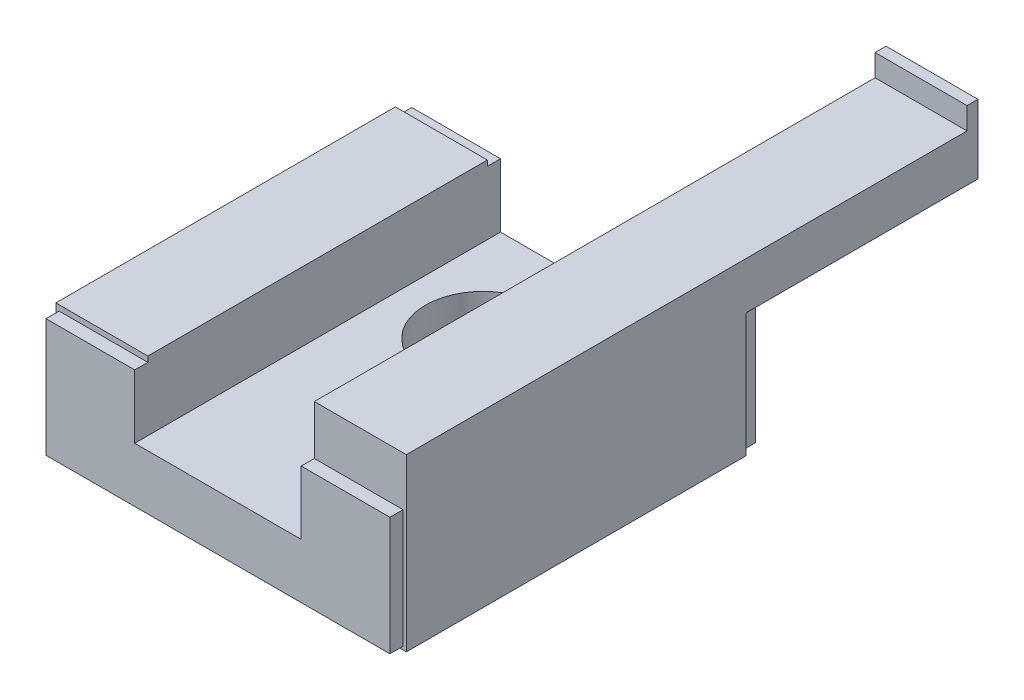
ISO-10303-21;
HEADER;
FILE_DESCRIPTION(('STEP AP214'),'2;1');
FILE_NAME('part.step','',(''),(''),'','','');
FILE_SCHEMA(('AUTOMOTIVE_DESIGN { 1 0 10303 214 1 1 1 1 }'));
ENDSEC;
DATA;
#1=APPLICATION_CONTEXT('core data for automotive mechanical design processes');
#2=APPLICATION_PROTOCOL_DEFINITION('international standard','automotive_design',2000,#1);
#3=PRODUCT_CONTEXT('',#1,'mechanical');
#4=PRODUCT('Part','Part','',(#3));
#5=PRODUCT_RELATED_PRODUCT_CATEGORY('part','',(#4));
#6=PRODUCT_DEFINITION_FORMATION('','',#4);
#7=PRODUCT_DEFINITION_CONTEXT('part definition',#1,'design');
#8=PRODUCT_DEFINITION('design','',#6,#7);
#9=PRODUCT_DEFINITION_SHAPE('','',#8);
#10=(LENGTH_UNIT() NAMED_UNIT(*) SI_UNIT(.MILLI.,.METRE.));
#11=(NAMED_UNIT(*) PLANE_ANGLE_UNIT() SI_UNIT($,.RADIAN.));
#12=(NAMED_UNIT(*) SI_UNIT($,.STERADIAN.) SOLID_ANGLE_UNIT());
#13=UNCERTAINTY_MEASURE_WITH_UNIT(LENGTH_MEASURE(1.E-05),#10,'distance_accuracy_value','');
#14=(GEOMETRIC_REPRESENTATION_CONTEXT(3) GLOBAL_UNCERTAINTY_ASSIGNED_CONTEXT((#13)) GLOBAL_UNIT_ASSIGNED_CONTEXT((#10,
#11,#12)) REPRESENTATION_CONTEXT('',''));
#15=CARTESIAN_POINT('',(0.,0.,0.));
#16=DIRECTION('',(0.,0.,1.));
#17=DIRECTION('',(1.,0.,0.));
#18=AXIS2_PLACEMENT_3D('',#15,#16,#17);
#19=CARTESIAN_POINT('',(7.6,15.6,32.2));
#20=DIRECTION('',(0.,1.,0.));
#21=DIRECTION('',(1.,0.,0.));
#22=AXIS2_PLACEMENT_3D('',#19,#20,#21);
#23=PLANE('',#22);
#24=DIRECTION('',(-1.,0.,0.));
#25=VECTOR('',#24,1.);
#26=CARTESIAN_POINT('',(16.,15.6,-19.));
#27=LINE('',#26,#25);
#28=CARTESIAN_POINT('',(7.6,15.6,-19.));
#29=VERTEX_POINT('',#28);
#30=CARTESIAN_POINT('',(16.,15.6,-19.));
#31=VERTEX_POINT('',#30);
#32=EDGE_CURVE('E197',#29,#31,#27,.F.);
#33=ORIENTED_EDGE('',*,*,#32,.F.);
#34=DIRECTION('',(0.,0.,1.));
#35=VECTOR('',#34,1.);
#36=CARTESIAN_POINT('',(7.6,15.6,-19.));
#37=LINE('',#36,#35);
#38=CARTESIAN_POINT('',(7.6,15.6,32.2));
#39=VERTEX_POINT('',#38);
#40=EDGE_CURVE('E212',#39,#29,#37,.F.);
#41=ORIENTED_EDGE('',*,*,#40,.F.);
#42=DIRECTION('',(1.,0.,0.));
#43=VECTOR('',#42,1.);
#44=CARTESIAN_POINT('',(7.6,15.6,32.2));
#45=LINE('',#44,#43);
#46=CARTESIAN_POINT('',(16.,15.6,32.2));
#47=VERTEX_POINT('',#46);
#48=EDGE_CURVE('E221',#47,#39,#45,.F.);
#49=ORIENTED_EDGE('',*,*,#48,.F.);
#50=DIRECTION('',(0.,0.,-1.));
#51=VECTOR('',#50,1.);
#52=CARTESIAN_POINT('',(16.,15.6,32.2));
#53=LINE('',#52,#51);
#54=EDGE_CURVE('E214',#47,#31,#53,.T.);
#55=ORIENTED_EDGE('',*,*,#54,.T.);
#56=EDGE_LOOP('',(#33,#41,#49,#55));
#57=FACE_BOUND('',#56,.T.);
#58=ADVANCED_FACE('F16',(#57),#23,.T.);
#59=CARTESIAN_POINT('',(-16.,11.6,32.2));
#60=DIRECTION('',(0.,1.,0.));
#61=DIRECTION('',(1.,0.,0.));
#62=AXIS2_PLACEMENT_3D('',#59,#60,#61);
#63=PLANE('',#62);
#64=DIRECTION('',(1.,0.,0.));
#65=VECTOR('',#64,1.);
#66=CARTESIAN_POINT('',(-16.,11.6,32.2));
#67=LINE('',#66,#65);
#68=CARTESIAN_POINT('',(-7.6,11.6,32.2));
#69=VERTEX_POINT('',#68);
#70=CARTESIAN_POINT('',(-16.,11.6,32.2));
#71=VERTEX_POINT('',#70);
#72=EDGE_CURVE('E232',#69,#71,#67,.F.);
#73=ORIENTED_EDGE('',*,*,#72,.F.);
#74=DIRECTION('',(0.,0.,-1.));
#75=VECTOR('',#74,1.);
#76=CARTESIAN_POINT('',(-7.6,11.6,32.2));
#77=LINE('',#76,#75);
#78=CARTESIAN_POINT('',(-7.6,11.6,1.20000000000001));
#79=VERTEX_POINT('',#78);
#80=EDGE_CURVE('E236',#69,#79,#77,.T.);
#81=ORIENTED_EDGE('',*,*,#80,.T.);
#82=DIRECTION('',(-1.,0.,0.));
#83=VECTOR('',#82,1.);
#84=CARTESIAN_POINT('',(-7.6,11.6,1.20000000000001));
#85=LINE('',#84,#83);
#86=CARTESIAN_POINT('',(-16.,11.6,1.20000000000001));
#87=VERTEX_POINT('',#86);
#88=EDGE_CURVE('E241',#79,#87,#85,.T.);
#89=ORIENTED_EDGE('',*,*,#88,.T.);
#90=DIRECTION('',(0.,0.,1.));
#91=VECTOR('',#90,1.);
#92=CARTESIAN_POINT('',(-16.,11.6,1.20000000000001));
#93=LINE('',#92,#91);
#94=EDGE_CURVE('E246',#71,#87,#93,.F.);
#95=ORIENTED_EDGE('',*,*,#94,.F.);
#96=EDGE_LOOP('',(#73,#81,#89,#95));
#97=FACE_BOUND('',#96,.T.);
#98=ADVANCED_FACE('F638',(#97),#63,.T.);
#99=CARTESIAN_POINT('',(-16.,0.,32.2));
#100=DIRECTION('',(-1.,0.,0.));
#101=DIRECTION('',(0.,1.,0.));
#102=AXIS2_PLACEMENT_3D('',#99,#100,#101);
#103=PLANE('',#102);
#104=DIRECTION('',(0.,1.,0.));
#105=VECTOR('',#104,1.);
#106=CARTESIAN_POINT('',(-16.,0.,32.2));
#107=LINE('',#106,#105);
#108=CARTESIAN_POINT('',(-16.,0.,32.2));
#109=VERTEX_POINT('',#108);
#110=EDGE_CURVE('E251',#71,#109,#107,.F.);
#111=ORIENTED_EDGE('',*,*,#110,.F.);
#112=ORIENTED_EDGE('',*,*,#94,.T.);
#113=DIRECTION('',(0.,-1.,0.));
#114=VECTOR('',#113,1.);
#115=CARTESIAN_POINT('',(-16.,11.6,1.20000000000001));
#116=LINE('',#115,#114);
#117=CARTESIAN_POINT('',(-16.,0.,1.20000000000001));
#118=VERTEX_POINT('',#117);
#119=EDGE_CURVE('E255',#87,#118,#116,.T.);
#120=ORIENTED_EDGE('',*,*,#119,.T.);
#121=DIRECTION('',(0.,0.,1.));
#122=VECTOR('',#121,1.);
#123=CARTESIAN_POINT('',(-16.,0.,1.20000000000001));
#124=LINE('',#123,#122);
#125=EDGE_CURVE('E260',#109,#118,#124,.F.);
#126=ORIENTED_EDGE('',*,*,#125,.F.);
#127=EDGE_LOOP('',(#111,#112,#120,#126));
#128=FACE_BOUND('',#127,.T.);
#129=ADVANCED_FACE('F643',(#128),#103,.T.);
#130=CARTESIAN_POINT('',(-16.,0.,1.2));
#131=DIRECTION('',(0.,-1.,0.));
#132=DIRECTION('',(1.,0.,0.));
#133=AXIS2_PLACEMENT_3D('',#130,#131,#132);
#134=PLANE('',#133);
#135=DIRECTION('',(-1.,0.,0.));
#136=VECTOR('',#135,1.);
#137=CARTESIAN_POINT('',(-8.,0.,32.2));
#138=LINE('',#137,#136);
#139=CARTESIAN_POINT('',(-8.,0.,32.2));
#140=VERTEX_POINT('',#139);
#141=EDGE_CURVE('E265',#109,#140,#138,.F.);
#142=ORIENTED_EDGE('',*,*,#141,.F.);
#143=ORIENTED_EDGE('',*,*,#125,.T.);
#144=DIRECTION('',(1.,0.,0.));
#145=VECTOR('',#144,1.);
#146=CARTESIAN_POINT('',(-16.,0.,1.2));
#147=LINE('',#146,#145);
#148=CARTESIAN_POINT('',(-8.,0.,1.2));
#149=VERTEX_POINT('',#148);
#150=EDGE_CURVE('E269',#118,#149,#147,.T.);
#151=ORIENTED_EDGE('',*,*,#150,.T.);
#152=DIRECTION('',(0.,0.,1.));
#153=VECTOR('',#152,1.);
#154=CARTESIAN_POINT('',(-8.,0.,1.2));
#155=LINE('',#154,#153);
#156=EDGE_CURVE('E274',#140,#149,#155,.F.);
#157=ORIENTED_EDGE('',*,*,#156,.F.);
#158=EDGE_LOOP('',(#142,#143,#151,#157));
#159=FACE_BOUND('',#158,.T.);
#160=CARTESIAN_POINT('',(-12.,0.,8.7));
#161=DIRECTION('',(0.,1.,0.));
#162=DIRECTION('',(0.,0.,-1.));
#163=AXIS2_PLACEMENT_3D('',#160,#161,#162);
#164=CIRCLE('',#163,2.);
#165=CARTESIAN_POINT('',(-12.,0.,6.7));
#166=VERTEX_POINT('',#165);
#167=EDGE_CURVE('E279',#166,#166,#164,.F.);
#168=ORIENTED_EDGE('',*,*,#167,.F.);
#169=EDGE_LOOP('',(#168));
#170=FACE_BOUND('',#169,.T.);
#171=CARTESIAN_POINT('',(-12.,0.,24.7));
#172=DIRECTION('',(0.,1.,0.));
#173=DIRECTION('',(0.,0.,-1.));
#174=AXIS2_PLACEMENT_3D('',#171,#172,#173);
#175=CIRCLE('',#174,2.);
#176=CARTESIAN_POINT('',(-12.,0.,22.7));
#177=VERTEX_POINT('',#176);
#178=EDGE_CURVE('E284',#177,#177,#175,.F.);
#179=ORIENTED_EDGE('',*,*,#178,.F.);
#180=EDGE_LOOP('',(#179));
#181=FACE_BOUND('',#180,.T.);
#182=ADVANCED_FACE('F649',(#159,#170,#181),#134,.T.);
#183=CARTESIAN_POINT('',(-7.7,0.300000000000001,1.2));
#184=DIRECTION('',(0.707106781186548,-0.707106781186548,0.));
#185=DIRECTION('',(0.,0.,1.));
#186=AXIS2_PLACEMENT_3D('',#183,#184,#185);
#187=PLANE('',#186);
#188=DIRECTION('',(-0.707106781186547,-0.707106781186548,0.));
#189=VECTOR('',#188,1.);
#190=CARTESIAN_POINT('',(-7.7,0.299999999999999,32.2));
#191=LINE('',#190,#189);
#192=CARTESIAN_POINT('',(-7.7,0.299999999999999,32.2));
#193=VERTEX_POINT('',#192);
#194=EDGE_CURVE('E287',#140,#193,#191,.F.);
#195=ORIENTED_EDGE('',*,*,#194,.F.);
#196=ORIENTED_EDGE('',*,*,#156,.T.);
#197=DIRECTION('',(0.707106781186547,0.707106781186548,0.));
#198=VECTOR('',#197,1.);
#199=CARTESIAN_POINT('',(-8.,0.,1.2));
#200=LINE('',#199,#198);
#201=CARTESIAN_POINT('',(-7.7,0.300000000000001,1.2));
#202=VERTEX_POINT('',#201);
#203=EDGE_CURVE('E289',#149,#202,#200,.T.);
#204=ORIENTED_EDGE('',*,*,#203,.T.);
#205=DIRECTION('',(0.,0.,1.));
#206=VECTOR('',#205,1.);
#207=CARTESIAN_POINT('',(-7.7,0.300000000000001,1.2));
#208=LINE('',#207,#206);
#209=EDGE_CURVE('E294',#193,#202,#208,.F.);
#210=ORIENTED_EDGE('',*,*,#209,.F.);
#211=EDGE_LOOP('',(#195,#196,#204,#210));
#212=FACE_BOUND('',#211,.T.);
#213=ADVANCED_FACE('F653',(#212),#187,.T.);
#214=CARTESIAN_POINT('',(8.,0.,1.2));
#215=DIRECTION('',(-0.707106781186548,-0.707106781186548,0.));
#216=DIRECTION('',(0.,0.,1.));
#217=AXIS2_PLACEMENT_3D('',#214,#215,#216);
#218=PLANE('',#217);
#219=DIRECTION('',(-0.707106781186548,0.707106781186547,0.));
#220=VECTOR('',#219,1.);
#221=CARTESIAN_POINT('',(8.,0.,32.2));
#222=LINE('',#221,#220);
#223=CARTESIAN_POINT('',(7.7,0.3,32.2));
#224=VERTEX_POINT('',#223);
#225=CARTESIAN_POINT('',(8.,0.,32.2));
#226=VERTEX_POINT('',#225);
#227=EDGE_CURVE('E299',#224,#226,#222,.F.);
#228=ORIENTED_EDGE('',*,*,#227,.F.);
#229=DIRECTION('',(0.,0.,-1.));
#230=VECTOR('',#229,1.);
#231=CARTESIAN_POINT('',(7.7,0.3,32.2));
#232=LINE('',#231,#230);
#233=CARTESIAN_POINT('',(7.7,0.299999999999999,1.2));
#234=VERTEX_POINT('',#233);
#235=EDGE_CURVE('E303',#224,#234,#232,.T.);
#236=ORIENTED_EDGE('',*,*,#235,.T.);
#237=DIRECTION('',(0.707106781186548,-0.707106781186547,0.));
#238=VECTOR('',#237,1.);
#239=CARTESIAN_POINT('',(7.7,0.299999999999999,1.2));
#240=LINE('',#239,#238);
#241=CARTESIAN_POINT('',(8.,0.,1.2));
#242=VERTEX_POINT('',#241);
#243=EDGE_CURVE('E308',#234,#242,#240,.T.);
#244=ORIENTED_EDGE('',*,*,#243,.T.);
#245=DIRECTION('',(0.,0.,1.));
#246=VECTOR('',#245,1.);
#247=CARTESIAN_POINT('',(8.,0.,1.2));
#248=LINE('',#247,#246);
#249=EDGE_CURVE('E313',#226,#242,#248,.F.);
#250=ORIENTED_EDGE('',*,*,#249,.F.);
#251=EDGE_LOOP('',(#228,#236,#244,#250));
#252=FACE_BOUND('',#251,.T.);
#253=ADVANCED_FACE('F657',(#252),#218,.T.);
#254=CARTESIAN_POINT('',(8.,0.,1.2));
#255=DIRECTION('',(0.,-1.,0.));
#256=DIRECTION('',(1.,0.,0.));
#257=AXIS2_PLACEMENT_3D('',#254,#255,#256);
#258=PLANE('',#257);
#259=DIRECTION('',(-1.,0.,0.));
#260=VECTOR('',#259,1.);
#261=CARTESIAN_POINT('',(16.,0.,32.2));
#262=LINE('',#261,#260);
#263=CARTESIAN_POINT('',(16.,0.,32.2));
#264=VERTEX_POINT('',#263);
#265=EDGE_CURVE('E318',#226,#264,#262,.F.);
#266=ORIENTED_EDGE('',*,*,#265,.F.);
#267=ORIENTED_EDGE('',*,*,#249,.T.);
#268=DIRECTION('',(1.,0.,0.));
#269=VECTOR('',#268,1.);
#270=CARTESIAN_POINT('',(8.,0.,1.2));
#271=LINE('',#270,#269);
#272=CARTESIAN_POINT('',(16.,0.,1.2));
#273=VERTEX_POINT('',#272);
#274=EDGE_CURVE('E322',#242,#273,#271,.T.);
#275=ORIENTED_EDGE('',*,*,#274,.T.);
#276=DIRECTION('',(0.,0.,1.));
#277=VECTOR('',#276,1.);
#278=CARTESIAN_POINT('',(16.,0.,1.2));
#279=LINE('',#278,#277);
#280=EDGE_CURVE('E327',#264,#273,#279,.F.);
#281=ORIENTED_EDGE('',*,*,#280,.F.);
#282=EDGE_LOOP('',(#266,#267,#275,#281));
#283=FACE_BOUND('',#282,.T.);
#284=CARTESIAN_POINT('',(12.,0.,8.7));
#285=DIRECTION('',(0.,1.,0.));
#286=DIRECTION('',(0.,0.,-1.));
#287=AXIS2_PLACEMENT_3D('',#284,#285,#286);
#288=CIRCLE('',#287,2.);
#289=CARTESIAN_POINT('',(12.,0.,6.7));
#290=VERTEX_POINT('',#289);
#291=EDGE_CURVE('E332',#290,#290,#288,.F.);
#292=ORIENTED_EDGE('',*,*,#291,.F.);
#293=EDGE_LOOP('',(#292));
#294=FACE_BOUND('',#293,.T.);
#295=CARTESIAN_POINT('',(12.,0.,24.7));
#296=DIRECTION('',(0.,1.,0.));
#297=DIRECTION('',(0.,0.,-1.));
#298=AXIS2_PLACEMENT_3D('',#295,#296,#297);
#299=CIRCLE('',#298,2.);
#300=CARTESIAN_POINT('',(12.,0.,22.7));
#301=VERTEX_POINT('',#300);
#302=EDGE_CURVE('E337',#301,#301,#299,.F.);
#303=ORIENTED_EDGE('',*,*,#302,.F.);
#304=EDGE_LOOP('',(#303));
#305=FACE_BOUND('',#304,.T.);
#306=ADVANCED_FACE('F661',(#283,#294,#305),#258,.T.);
#307=CARTESIAN_POINT('',(16.,0.,-20.));
#308=DIRECTION('',(1.,0.,0.));
#309=DIRECTION('',(0.,1.,0.));
#310=AXIS2_PLACEMENT_3D('',#307,#308,#309);
#311=PLANE('',#310);
#312=DIRECTION('',(0.,-1.,0.));
#313=VECTOR('',#312,1.);
#314=CARTESIAN_POINT('',(16.,15.6,32.2));
#315=LINE('',#314,#313);
#316=EDGE_CURVE('E340',#264,#47,#315,.F.);
#317=ORIENTED_EDGE('',*,*,#316,.F.);
#318=ORIENTED_EDGE('',*,*,#280,.T.);
#319=DIRECTION('',(0.,1.,0.));
#320=VECTOR('',#319,1.);
#321=CARTESIAN_POINT('',(16.,0.,1.2));
#322=LINE('',#321,#320);
#323=CARTESIAN_POINT('',(16.,11.3,1.2));
#324=VERTEX_POINT('',#323);
#325=EDGE_CURVE('E342',#273,#324,#322,.T.);
#326=ORIENTED_EDGE('',*,*,#325,.T.);
#327=DIRECTION('',(0.,0.,-1.));
#328=VECTOR('',#327,1.);
#329=CARTESIAN_POINT('',(16.,11.3,1.2));
#330=LINE('',#329,#328);
#331=CARTESIAN_POINT('',(16.,11.3,-20.));
#332=VERTEX_POINT('',#331);
#333=EDGE_CURVE('E347',#332,#324,#330,.F.);
#334=ORIENTED_EDGE('',*,*,#333,.F.);
#335=DIRECTION('',(0.,1.,0.));
#336=VECTOR('',#335,1.);
#337=CARTESIAN_POINT('',(16.,11.3,-20.));
#338=LINE('',#337,#336);
#339=CARTESIAN_POINT('',(16.,17.6,-20.));
#340=VERTEX_POINT('',#339);
#341=EDGE_CURVE('E351',#332,#340,#338,.T.);
#342=ORIENTED_EDGE('',*,*,#341,.T.);
#343=DIRECTION('',(0.,0.,1.));
#344=VECTOR('',#343,1.);
#345=CARTESIAN_POINT('',(16.,17.6,-20.));
#346=LINE('',#345,#344);
#347=CARTESIAN_POINT('',(16.,17.6,-19.));
#348=VERTEX_POINT('',#347);
#349=EDGE_CURVE('E356',#348,#340,#346,.F.);
#350=ORIENTED_EDGE('',*,*,#349,.F.);
#351=DIRECTION('',(0.,-1.,0.));
#352=VECTOR('',#351,1.);
#353=CARTESIAN_POINT('',(16.,17.6,-19.));
#354=LINE('',#353,#352);
#355=EDGE_CURVE('E360',#31,#348,#354,.F.);
#356=ORIENTED_EDGE('',*,*,#355,.F.);
#357=ORIENTED_EDGE('',*,*,#54,.F.);
#358=EDGE_LOOP('',(#317,#318,#326,#334,#342,#350,#356,#357));
#359=FACE_BOUND('',#358,.T.);
#360=ADVANCED_FACE('F665',(#359),#311,.T.);
#361=CARTESIAN_POINT('',(7.6,5.3,33.4));
#362=DIRECTION('',(-1.,0.,0.));
#363=DIRECTION('',(0.,1.,0.));
#364=AXIS2_PLACEMENT_3D('',#361,#362,#363);
#365=PLANE('',#364);
#366=DIRECTION('',(0.,0.,1.));
#367=VECTOR('',#366,1.);
#368=CARTESIAN_POINT('',(7.6,11.3,-20.));
#369=LINE('',#368,#367);
#370=CARTESIAN_POINT('',(7.6,11.3,-20.));
#371=VERTEX_POINT('',#370);
#372=CARTESIAN_POINT('',(7.6,11.3,0.));
#373=VERTEX_POINT('',#372);
#374=EDGE_CURVE('E364',#371,#373,#369,.T.);
#375=ORIENTED_EDGE('',*,*,#374,.T.);
#376=DIRECTION('',(0.,-1.,0.));
#377=VECTOR('',#376,1.);
#378=CARTESIAN_POINT('',(7.6,11.3,0.));
#379=LINE('',#378,#377);
#380=CARTESIAN_POINT('',(7.6,5.3,0.));
#381=VERTEX_POINT('',#380);
#382=EDGE_CURVE('E368',#373,#381,#379,.T.);
#383=ORIENTED_EDGE('',*,*,#382,.T.);
#384=DIRECTION('',(0.,0.,1.));
#385=VECTOR('',#384,1.);
#386=CARTESIAN_POINT('',(7.6,5.3,0.));
#387=LINE('',#386,#385);
#388=CARTESIAN_POINT('',(7.6,5.3,33.4));
#389=VERTEX_POINT('',#388);
#390=EDGE_CURVE('E373',#389,#381,#387,.F.);
#391=ORIENTED_EDGE('',*,*,#390,.F.);
#392=DIRECTION('',(0.,1.,0.));
#393=VECTOR('',#392,1.);
#394=CARTESIAN_POINT('',(7.6,5.3,33.4));
#395=LINE('',#394,#393);
#396=CARTESIAN_POINT('',(7.6,11.1,33.4));
#397=VERTEX_POINT('',#396);
#398=EDGE_CURVE('E377',#397,#389,#395,.F.);
#399=ORIENTED_EDGE('',*,*,#398,.F.);
#400=DIRECTION('',(0.,0.,-1.));
#401=VECTOR('',#400,1.);
#402=CARTESIAN_POINT('',(7.6,11.1,33.4));
#403=LINE('',#402,#401);
#404=CARTESIAN_POINT('',(7.6,11.1,32.2));
#405=VERTEX_POINT('',#404);
#406=EDGE_CURVE('E381',#405,#397,#403,.F.);
#407=ORIENTED_EDGE('',*,*,#406,.F.);
#408=DIRECTION('',(0.,1.,0.));
#409=VECTOR('',#408,1.);
#410=CARTESIAN_POINT('',(7.6,11.1,32.2));
#411=LINE('',#410,#409);
#412=EDGE_CURVE('E206',#39,#405,#411,.F.);
#413=ORIENTED_EDGE('',*,*,#412,.F.);
#414=ORIENTED_EDGE('',*,*,#40,.T.);
#415=DIRECTION('',(0.,1.,0.));
#416=VECTOR('',#415,1.);
#417=CARTESIAN_POINT('',(7.6,15.6,-19.));
#418=LINE('',#417,#416);
#419=CARTESIAN_POINT('',(7.6,17.6,-19.));
#420=VERTEX_POINT('',#419);
#421=EDGE_CURVE('E194',#420,#29,#418,.F.);
#422=ORIENTED_EDGE('',*,*,#421,.F.);
#423=DIRECTION('',(0.,0.,-1.));
#424=VECTOR('',#423,1.);
#425=CARTESIAN_POINT('',(7.6,17.6,-19.));
#426=LINE('',#425,#424);
#427=CARTESIAN_POINT('',(7.6,17.6,-20.));
#428=VERTEX_POINT('',#427);
#429=EDGE_CURVE('E205',#420,#428,#426,.T.);
#430=ORIENTED_EDGE('',*,*,#429,.T.);
#431=DIRECTION('',(0.,-1.,0.));
#432=VECTOR('',#431,1.);
#433=CARTESIAN_POINT('',(7.6,17.6,-20.));
#434=LINE('',#433,#432);
#435=EDGE_CURVE('E393',#428,#371,#434,.T.);
#436=ORIENTED_EDGE('',*,*,#435,.T.);
#437=EDGE_LOOP('',(#375,#383,#391,#399,#407,#413,#414,#422,#430,#436));
#438=FACE_BOUND('',#437,.T.);
#439=ADVANCED_FACE('F218',(#438),#365,.T.);
#440=CARTESIAN_POINT('',(-7.6,5.3,0.));
#441=DIRECTION('',(1.,0.,0.));
#442=DIRECTION('',(0.,1.,0.));
#443=AXIS2_PLACEMENT_3D('',#440,#441,#442);
#444=PLANE('',#443);
#445=DIRECTION('',(0.,-1.,0.));
#446=VECTOR('',#445,1.);
#447=CARTESIAN_POINT('',(-7.6,11.6,32.2));
#448=LINE('',#447,#446);
#449=CARTESIAN_POINT('',(-7.6,11.1,32.2));
#450=VERTEX_POINT('',#449);
#451=EDGE_CURVE('E398',#450,#69,#448,.F.);
#452=ORIENTED_EDGE('',*,*,#451,.F.);
#453=DIRECTION('',(0.,0.,1.));
#454=VECTOR('',#453,1.);
#455=CARTESIAN_POINT('',(-7.6,11.1,32.2));
#456=LINE('',#455,#454);
#457=CARTESIAN_POINT('',(-7.6,11.1,33.4));
#458=VERTEX_POINT('',#457);
#459=EDGE_CURVE('E402',#450,#458,#456,.T.);
#460=ORIENTED_EDGE('',*,*,#459,.T.);
#461=DIRECTION('',(0.,-1.,0.));
#462=VECTOR('',#461,1.);
#463=CARTESIAN_POINT('',(-7.6,11.1,33.4));
#464=LINE('',#463,#462);
#465=CARTESIAN_POINT('',(-7.6,5.3,33.4));
#466=VERTEX_POINT('',#465);
#467=EDGE_CURVE('E407',#466,#458,#464,.F.);
#468=ORIENTED_EDGE('',*,*,#467,.F.);
#469=DIRECTION('',(0.,0.,-1.));
#470=VECTOR('',#469,1.);
#471=CARTESIAN_POINT('',(-7.6,5.3,33.4));
#472=LINE('',#471,#470);
#473=CARTESIAN_POINT('',(-7.6,5.3,0.));
#474=VERTEX_POINT('',#473);
#475=EDGE_CURVE('E412',#466,#474,#472,.T.);
#476=ORIENTED_EDGE('',*,*,#475,.T.);
#477=DIRECTION('',(0.,1.,0.));
#478=VECTOR('',#477,1.);
#479=CARTESIAN_POINT('',(-7.6,5.3,0.));
#480=LINE('',#479,#478);
#481=CARTESIAN_POINT('',(-7.6,11.1,0.));
#482=VERTEX_POINT('',#481);
#483=EDGE_CURVE('E417',#474,#482,#480,.T.);
#484=ORIENTED_EDGE('',*,*,#483,.T.);
#485=DIRECTION('',(0.,0.,1.));
#486=VECTOR('',#485,1.);
#487=CARTESIAN_POINT('',(-7.6,11.1,0.));
#488=LINE('',#487,#486);
#489=CARTESIAN_POINT('',(-7.6,11.1,1.2));
#490=VERTEX_POINT('',#489);
#491=EDGE_CURVE('E422',#490,#482,#488,.F.);
#492=ORIENTED_EDGE('',*,*,#491,.F.);
#493=DIRECTION('',(0.,1.,0.));
#494=VECTOR('',#493,1.);
#495=CARTESIAN_POINT('',(-7.6,11.1,1.2));
#496=LINE('',#495,#494);
#497=EDGE_CURVE('E426',#490,#79,#496,.T.);
#498=ORIENTED_EDGE('',*,*,#497,.T.);
#499=ORIENTED_EDGE('',*,*,#80,.F.);
#500=EDGE_LOOP('',(#452,#460,#468,#476,#484,#492,#498,#499));
#501=FACE_BOUND('',#500,.T.);
#502=ADVANCED_FACE('F672',(#501),#444,.T.);
#503=CARTESIAN_POINT('',(-15.7,0.3,0.));
#504=DIRECTION('',(0.,0.,-1.));
#505=DIRECTION('',(0.,1.,0.));
#506=AXIS2_PLACEMENT_3D('',#503,#504,#505);
#507=PLANE('',#506);
#508=ORIENTED_EDGE('',*,*,#382,.F.);
#509=DIRECTION('',(1.,0.,0.));
#510=VECTOR('',#509,1.);
#511=CARTESIAN_POINT('',(7.6,11.3,0.));
#512=LINE('',#511,#510);
#513=CARTESIAN_POINT('',(15.7,11.3,0.));
#514=VERTEX_POINT('',#513);
#515=EDGE_CURVE('E431',#373,#514,#512,.T.);
#516=ORIENTED_EDGE('',*,*,#515,.T.);
#517=DIRECTION('',(0.,-1.,0.));
#518=VECTOR('',#517,1.);
#519=CARTESIAN_POINT('',(15.7,11.3,0.));
#520=LINE('',#519,#518);
#521=CARTESIAN_POINT('',(15.7,0.300000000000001,0.));
#522=VERTEX_POINT('',#521);
#523=EDGE_CURVE('E436',#514,#522,#520,.T.);
#524=ORIENTED_EDGE('',*,*,#523,.T.);
#525=DIRECTION('',(-1.,0.,0.));
#526=VECTOR('',#525,1.);
#527=CARTESIAN_POINT('',(15.7,0.3,0.));
#528=LINE('',#527,#526);
#529=CARTESIAN_POINT('',(-15.7,0.3,0.));
#530=VERTEX_POINT('',#529);
#531=EDGE_CURVE('E441',#530,#522,#528,.F.);
#532=ORIENTED_EDGE('',*,*,#531,.F.);
#533=DIRECTION('',(0.,1.,0.));
#534=VECTOR('',#533,1.);
#535=CARTESIAN_POINT('',(-15.7,0.3,0.));
#536=LINE('',#535,#534);
#537=CARTESIAN_POINT('',(-15.7,11.1,0.));
#538=VERTEX_POINT('',#537);
#539=EDGE_CURVE('E446',#530,#538,#536,.T.);
#540=ORIENTED_EDGE('',*,*,#539,.T.);
#541=DIRECTION('',(1.,0.,0.));
#542=VECTOR('',#541,1.);
#543=CARTESIAN_POINT('',(-15.7,11.1,0.));
#544=LINE('',#543,#542);
#545=EDGE_CURVE('E451',#538,#482,#544,.T.);
#546=ORIENTED_EDGE('',*,*,#545,.T.);
#547=ORIENTED_EDGE('',*,*,#483,.F.);
#548=DIRECTION('',(1.,0.,0.));
#549=VECTOR('',#548,1.);
#550=CARTESIAN_POINT('',(-7.6,5.3,0.));
#551=LINE('',#550,#549);
#552=EDGE_CURVE('E456',#381,#474,#551,.F.);
#553=ORIENTED_EDGE('',*,*,#552,.F.);
#554=EDGE_LOOP('',(#508,#516,#524,#532,#540,#546,#547,#553));
#555=FACE_BOUND('',#554,.T.);
#556=ADVANCED_FACE('F675',(#555),#507,.T.);
#557=CARTESIAN_POINT('',(-15.7,0.3,0.));
#558=DIRECTION('',(0.,-1.,0.));
#559=DIRECTION('',(1.,0.,0.));
#560=AXIS2_PLACEMENT_3D('',#557,#558,#559);
#561=PLANE('',#560);
#562=DIRECTION('',(-1.,0.,0.));
#563=VECTOR('',#562,1.);
#564=CARTESIAN_POINT('',(15.7,0.3,33.4));
#565=LINE('',#564,#563);
#566=CARTESIAN_POINT('',(-15.7,0.3,33.4));
#567=VERTEX_POINT('',#566);
#568=CARTESIAN_POINT('',(15.7,0.3,33.4));
#569=VERTEX_POINT('',#568);
#570=EDGE_CURVE('E460',#567,#569,#565,.F.);
#571=ORIENTED_EDGE('',*,*,#570,.F.);
#572=DIRECTION('',(0.,0.,-1.));
#573=VECTOR('',#572,1.);
#574=CARTESIAN_POINT('',(-15.7,0.3,33.4));
#575=LINE('',#574,#573);
#576=CARTESIAN_POINT('',(-15.7,0.3,32.2));
#577=VERTEX_POINT('',#576);
#578=EDGE_CURVE('E465',#577,#567,#575,.F.);
#579=ORIENTED_EDGE('',*,*,#578,.F.);
#580=DIRECTION('',(1.,0.,0.));
#581=VECTOR('',#580,1.);
#582=CARTESIAN_POINT('',(-15.7,0.3,32.2));
#583=LINE('',#582,#581);
#584=EDGE_CURVE('E469',#193,#577,#583,.F.);
#585=ORIENTED_EDGE('',*,*,#584,.F.);
#586=ORIENTED_EDGE('',*,*,#209,.T.);
#587=DIRECTION('',(-1.,0.,0.));
#588=VECTOR('',#587,1.);
#589=CARTESIAN_POINT('',(-7.7,0.3,1.2));
#590=LINE('',#589,#588);
#591=CARTESIAN_POINT('',(-15.7,0.3,1.2));
#592=VERTEX_POINT('',#591);
#593=EDGE_CURVE('E473',#202,#592,#590,.T.);
#594=ORIENTED_EDGE('',*,*,#593,.T.);
#595=DIRECTION('',(0.,0.,-1.));
#596=VECTOR('',#595,1.);
#597=CARTESIAN_POINT('',(-15.7,0.3,1.2));
#598=LINE('',#597,#596);
#599=EDGE_CURVE('E478',#592,#530,#598,.T.);
#600=ORIENTED_EDGE('',*,*,#599,.T.);
#601=ORIENTED_EDGE('',*,*,#531,.T.);
#602=DIRECTION('',(0.,0.,1.));
#603=VECTOR('',#602,1.);
#604=CARTESIAN_POINT('',(15.7,0.3,0.));
#605=LINE('',#604,#603);
#606=CARTESIAN_POINT('',(15.7,0.3,1.2));
#607=VERTEX_POINT('',#606);
#608=EDGE_CURVE('E483',#607,#522,#605,.F.);
#609=ORIENTED_EDGE('',*,*,#608,.F.);
#610=DIRECTION('',(-1.,0.,0.));
#611=VECTOR('',#610,1.);
#612=CARTESIAN_POINT('',(15.7,0.3,1.2));
#613=LINE('',#612,#611);
#614=EDGE_CURVE('E487',#607,#234,#613,.T.);
#615=ORIENTED_EDGE('',*,*,#614,.T.);
#616=ORIENTED_EDGE('',*,*,#235,.F.);
#617=DIRECTION('',(1.,0.,0.));
#618=VECTOR('',#617,1.);
#619=CARTESIAN_POINT('',(7.7,0.3,32.2));
#620=LINE('',#619,#618);
#621=CARTESIAN_POINT('',(15.7,0.3,32.2));
#622=VERTEX_POINT('',#621);
#623=EDGE_CURVE('E492',#622,#224,#620,.F.);
#624=ORIENTED_EDGE('',*,*,#623,.F.);
#625=DIRECTION('',(0.,0.,1.));
#626=VECTOR('',#625,1.);
#627=CARTESIAN_POINT('',(15.7,0.3,32.2));
#628=LINE('',#627,#626);
#629=EDGE_CURVE('E496',#622,#569,#628,.T.);
#630=ORIENTED_EDGE('',*,*,#629,.T.);
#631=EDGE_LOOP('',(#571,#579,#585,#586,#594,#600,#601,#609,#615,#616,#624,#630));
#632=FACE_BOUND('',#631,.T.);
#633=CARTESIAN_POINT('',(0.,0.3,9.2));
#634=DIRECTION('',(0.,1.,0.));
#635=DIRECTION('',(0.,0.,-1.));
#636=AXIS2_PLACEMENT_3D('',#633,#634,#635);
#637=CIRCLE('',#636,5.25);
#638=CARTESIAN_POINT('',(0.,0.3,3.95));
#639=VERTEX_POINT('',#638);
#640=EDGE_CURVE('E501',#639,#639,#637,.F.);
#641=ORIENTED_EDGE('',*,*,#640,.F.);
#642=EDGE_LOOP('',(#641));
#643=FACE_BOUND('',#642,.T.);
#644=CARTESIAN_POINT('',(0.,0.3,24.7));
#645=DIRECTION('',(0.,1.,0.));
#646=DIRECTION('',(0.,0.,-1.));
#647=AXIS2_PLACEMENT_3D('',#644,#645,#646);
#648=CIRCLE('',#647,1.5);
#649=CARTESIAN_POINT('',(0.,0.3,23.2));
#650=VERTEX_POINT('',#649);
#651=EDGE_CURVE('E506',#650,#650,#648,.F.);
#652=ORIENTED_EDGE('',*,*,#651,.F.);
#653=EDGE_LOOP('',(#652));
#654=FACE_BOUND('',#653,.T.);
#655=ADVANCED_FACE('F679',(#632,#643,#654),#561,.T.);
#656=CARTESIAN_POINT('',(-7.6,5.3,33.4));
#657=DIRECTION('',(0.,1.,0.));
#658=DIRECTION('',(1.,0.,0.));
#659=AXIS2_PLACEMENT_3D('',#656,#657,#658);
#660=PLANE('',#659);
#661=ORIENTED_EDGE('',*,*,#552,.T.);
#662=ORIENTED_EDGE('',*,*,#475,.F.);
#663=DIRECTION('',(1.,0.,0.));
#664=VECTOR('',#663,1.);
#665=CARTESIAN_POINT('',(-7.6,5.3,33.4));
#666=LINE('',#665,#664);
#667=EDGE_CURVE('E509',#389,#466,#666,.F.);
#668=ORIENTED_EDGE('',*,*,#667,.F.);
#669=ORIENTED_EDGE('',*,*,#390,.T.);
#670=EDGE_LOOP('',(#661,#662,#668,#669));
#671=FACE_BOUND('',#670,.T.);
#672=CARTESIAN_POINT('',(0.,5.3,9.2));
#673=DIRECTION('',(0.,-1.,0.));
#674=DIRECTION('',(0.,0.,1.));
#675=AXIS2_PLACEMENT_3D('',#672,#673,#674);
#676=CIRCLE('',#675,5.25);
#677=CARTESIAN_POINT('',(0.,5.3,14.45));
#678=VERTEX_POINT('',#677);
#679=EDGE_CURVE('E511',#678,#678,#676,.F.);
#680=ORIENTED_EDGE('',*,*,#679,.F.);
#681=EDGE_LOOP('',(#680));
#682=FACE_BOUND('',#681,.T.);
#683=ADVANCED_FACE('F683',(#671,#682),#660,.T.);
#684=CARTESIAN_POINT('',(-15.7,0.3,33.4));
#685=DIRECTION('',(0.,0.,1.));
#686=DIRECTION('',(1.,0.,0.));
#687=AXIS2_PLACEMENT_3D('',#684,#685,#686);
#688=PLANE('',#687);
#689=DIRECTION('',(-1.,0.,0.));
#690=VECTOR('',#689,1.);
#691=CARTESIAN_POINT('',(15.7,11.1,33.4));
#692=LINE('',#691,#690);
#693=CARTESIAN_POINT('',(15.7,11.1,33.4));
#694=VERTEX_POINT('',#693);
#695=EDGE_CURVE('E516',#397,#694,#692,.F.);
#696=ORIENTED_EDGE('',*,*,#695,.F.);
#697=ORIENTED_EDGE('',*,*,#398,.T.);
#698=ORIENTED_EDGE('',*,*,#667,.T.);
#699=ORIENTED_EDGE('',*,*,#467,.T.);
#700=DIRECTION('',(-1.,0.,0.));
#701=VECTOR('',#700,1.);
#702=CARTESIAN_POINT('',(-7.6,11.1,33.4));
#703=LINE('',#702,#701);
#704=CARTESIAN_POINT('',(-15.7,11.1,33.4));
#705=VERTEX_POINT('',#704);
#706=EDGE_CURVE('E519',#705,#458,#703,.F.);
#707=ORIENTED_EDGE('',*,*,#706,.F.);
#708=DIRECTION('',(0.,-1.,0.));
#709=VECTOR('',#708,1.);
#710=CARTESIAN_POINT('',(-15.7,11.1,33.4));
#711=LINE('',#710,#709);
#712=EDGE_CURVE('E523',#567,#705,#711,.F.);
#713=ORIENTED_EDGE('',*,*,#712,.F.);
#714=ORIENTED_EDGE('',*,*,#570,.T.);
#715=DIRECTION('',(0.,1.,0.));
#716=VECTOR('',#715,1.);
#717=CARTESIAN_POINT('',(15.7,0.300000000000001,33.4));
#718=LINE('',#717,#716);
#719=EDGE_CURVE('E527',#694,#569,#718,.F.);
#720=ORIENTED_EDGE('',*,*,#719,.F.);
#721=EDGE_LOOP('',(#696,#697,#698,#699,#707,#713,#714,#720));
#722=FACE_BOUND('',#721,.T.);
#723=ADVANCED_FACE('F687',(#722),#688,.T.);
#724=CARTESIAN_POINT('',(-15.7,11.1,0.));
#725=DIRECTION('',(0.,1.,0.));
#726=DIRECTION('',(0.,0.,1.));
#727=AXIS2_PLACEMENT_3D('',#724,#725,#726);
#728=PLANE('',#727);
#729=ORIENTED_EDGE('',*,*,#545,.F.);
#730=DIRECTION('',(0.,0.,1.));
#731=VECTOR('',#730,1.);
#732=CARTESIAN_POINT('',(-15.7,11.1,0.));
#733=LINE('',#732,#731);
#734=CARTESIAN_POINT('',(-15.7,11.1,1.2));
#735=VERTEX_POINT('',#734);
#736=EDGE_CURVE('E531',#735,#538,#733,.F.);
#737=ORIENTED_EDGE('',*,*,#736,.F.);
#738=DIRECTION('',(1.,0.,0.));
#739=VECTOR('',#738,1.);
#740=CARTESIAN_POINT('',(-15.7,11.1,1.2));
#741=LINE('',#740,#739);
#742=EDGE_CURVE('E535',#735,#490,#741,.T.);
#743=ORIENTED_EDGE('',*,*,#742,.T.);
#744=ORIENTED_EDGE('',*,*,#491,.T.);
#745=EDGE_LOOP('',(#729,#737,#743,#744));
#746=FACE_BOUND('',#745,.T.);
#747=ADVANCED_FACE('F691',(#746),#728,.T.);
#748=CARTESIAN_POINT('',(-15.7,0.3,0.));
#749=DIRECTION('',(-1.,0.,0.));
#750=DIRECTION('',(0.,0.,1.));
#751=AXIS2_PLACEMENT_3D('',#748,#749,#750);
#752=PLANE('',#751);
#753=ORIENTED_EDGE('',*,*,#539,.F.);
#754=ORIENTED_EDGE('',*,*,#599,.F.);
#755=DIRECTION('',(0.,1.,0.));
#756=VECTOR('',#755,1.);
#757=CARTESIAN_POINT('',(-15.7,0.3,1.2));
#758=LINE('',#757,#756);
#759=EDGE_CURVE('E540',#592,#735,#758,.T.);
#760=ORIENTED_EDGE('',*,*,#759,.T.);
#761=ORIENTED_EDGE('',*,*,#736,.T.);
#762=EDGE_LOOP('',(#753,#754,#760,#761));
#763=FACE_BOUND('',#762,.T.);
#764=ADVANCED_FACE('F695',(#763),#752,.T.);
#765=CARTESIAN_POINT('',(-16.,0.,1.2));
#766=DIRECTION('',(0.,0.,-1.));
#767=DIRECTION('',(0.,1.,0.));
#768=AXIS2_PLACEMENT_3D('',#765,#766,#767);
#769=PLANE('',#768);
#770=ORIENTED_EDGE('',*,*,#150,.F.);
#771=ORIENTED_EDGE('',*,*,#119,.F.);
#772=ORIENTED_EDGE('',*,*,#88,.F.);
#773=ORIENTED_EDGE('',*,*,#497,.F.);
#774=ORIENTED_EDGE('',*,*,#742,.F.);
#775=ORIENTED_EDGE('',*,*,#759,.F.);
#776=ORIENTED_EDGE('',*,*,#593,.F.);
#777=ORIENTED_EDGE('',*,*,#203,.F.);
#778=EDGE_LOOP('',(#770,#771,#772,#773,#774,#775,#776,#777));
#779=FACE_BOUND('',#778,.T.);
#780=ADVANCED_FACE('F699',(#779),#769,.T.);
#781=CARTESIAN_POINT('',(7.7,0.,1.2));
#782=DIRECTION('',(0.,0.,-1.));
#783=DIRECTION('',(0.,1.,0.));
#784=AXIS2_PLACEMENT_3D('',#781,#782,#783);
#785=PLANE('',#784);
#786=DIRECTION('',(0.,1.,0.));
#787=VECTOR('',#786,1.);
#788=CARTESIAN_POINT('',(15.7,0.300000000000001,1.2));
#789=LINE('',#788,#787);
#790=CARTESIAN_POINT('',(15.7,11.3,1.2));
#791=VERTEX_POINT('',#790);
#792=EDGE_CURVE('E545',#791,#607,#789,.F.);
#793=ORIENTED_EDGE('',*,*,#792,.F.);
#794=DIRECTION('',(1.,0.,0.));
#795=VECTOR('',#794,1.);
#796=CARTESIAN_POINT('',(15.7,11.3,1.2));
#797=LINE('',#796,#795);
#798=EDGE_CURVE('E549',#791,#324,#797,.T.);
#799=ORIENTED_EDGE('',*,*,#798,.T.);
#800=ORIENTED_EDGE('',*,*,#325,.F.);
#801=ORIENTED_EDGE('',*,*,#274,.F.);
#802=ORIENTED_EDGE('',*,*,#243,.F.);
#803=ORIENTED_EDGE('',*,*,#614,.F.);
#804=EDGE_LOOP('',(#793,#799,#800,#801,#802,#803));
#805=FACE_BOUND('',#804,.T.);
#806=ADVANCED_FACE('F703',(#805),#785,.T.);
#807=CARTESIAN_POINT('',(15.7,0.3,1.2));
#808=DIRECTION('',(1.,0.,0.));
#809=DIRECTION('',(0.,0.,-1.));
#810=AXIS2_PLACEMENT_3D('',#807,#808,#809);
#811=PLANE('',#810);
#812=DIRECTION('',(0.,0.,1.));
#813=VECTOR('',#812,1.);
#814=CARTESIAN_POINT('',(15.7,11.3,0.));
#815=LINE('',#814,#813);
#816=EDGE_CURVE('E554',#791,#514,#815,.F.);
#817=ORIENTED_EDGE('',*,*,#816,.F.);
#818=ORIENTED_EDGE('',*,*,#792,.T.);
#819=ORIENTED_EDGE('',*,*,#608,.T.);
#820=ORIENTED_EDGE('',*,*,#523,.F.);
#821=EDGE_LOOP('',(#817,#818,#819,#820));
#822=FACE_BOUND('',#821,.T.);
#823=ADVANCED_FACE('F707',(#822),#811,.T.);
#824=CARTESIAN_POINT('',(-15.7,11.1,33.4));
#825=DIRECTION('',(0.,1.,0.));
#826=DIRECTION('',(1.,0.,0.));
#827=AXIS2_PLACEMENT_3D('',#824,#825,#826);
#828=PLANE('',#827);
#829=ORIENTED_EDGE('',*,*,#706,.T.);
#830=ORIENTED_EDGE('',*,*,#459,.F.);
#831=DIRECTION('',(-1.,0.,0.));
#832=VECTOR('',#831,1.);
#833=CARTESIAN_POINT('',(-7.6,11.1,32.2));
#834=LINE('',#833,#832);
#835=CARTESIAN_POINT('',(-15.7,11.1,32.2));
#836=VERTEX_POINT('',#835);
#837=EDGE_CURVE('E558',#836,#450,#834,.F.);
#838=ORIENTED_EDGE('',*,*,#837,.F.);
#839=DIRECTION('',(0.,0.,1.));
#840=VECTOR('',#839,1.);
#841=CARTESIAN_POINT('',(-15.7,11.1,32.2));
#842=LINE('',#841,#840);
#843=EDGE_CURVE('E562',#836,#705,#842,.T.);
#844=ORIENTED_EDGE('',*,*,#843,.T.);
#845=EDGE_LOOP('',(#829,#830,#838,#844));
#846=FACE_BOUND('',#845,.T.);
#847=ADVANCED_FACE('F711',(#846),#828,.T.);
#848=CARTESIAN_POINT('',(-15.7,0.3,33.4));
#849=DIRECTION('',(-1.,0.,0.));
#850=DIRECTION('',(0.,1.,0.));
#851=AXIS2_PLACEMENT_3D('',#848,#849,#850);
#852=PLANE('',#851);
#853=ORIENTED_EDGE('',*,*,#712,.T.);
#854=ORIENTED_EDGE('',*,*,#843,.F.);
#855=DIRECTION('',(0.,-1.,0.));
#856=VECTOR('',#855,1.);
#857=CARTESIAN_POINT('',(-15.7,11.1,32.2));
#858=LINE('',#857,#856);
#859=EDGE_CURVE('E39',#577,#836,#858,.F.);
#860=ORIENTED_EDGE('',*,*,#859,.F.);
#861=ORIENTED_EDGE('',*,*,#578,.T.);
#862=EDGE_LOOP('',(#853,#854,#860,#861));
#863=FACE_BOUND('',#862,.T.);
#864=ADVANCED_FACE('F715',(#863),#852,.T.);
#865=CARTESIAN_POINT('',(-16.,0.,32.2));
#866=DIRECTION('',(0.,0.,1.));
#867=DIRECTION('',(1.,0.,0.));
#868=AXIS2_PLACEMENT_3D('',#865,#866,#867);
#869=PLANE('',#868);
#870=ORIENTED_EDGE('',*,*,#194,.T.);
#871=ORIENTED_EDGE('',*,*,#584,.T.);
#872=ORIENTED_EDGE('',*,*,#859,.T.);
#873=ORIENTED_EDGE('',*,*,#837,.T.);
#874=ORIENTED_EDGE('',*,*,#451,.T.);
#875=ORIENTED_EDGE('',*,*,#72,.T.);
#876=ORIENTED_EDGE('',*,*,#110,.T.);
#877=ORIENTED_EDGE('',*,*,#141,.T.);
#878=EDGE_LOOP('',(#870,#871,#872,#873,#874,#875,#876,#877));
#879=FACE_BOUND('',#878,.T.);
#880=ADVANCED_FACE('F719',(#879),#869,.T.);
#881=CARTESIAN_POINT('',(7.6,0.,32.2));
#882=DIRECTION('',(0.,0.,1.));
#883=DIRECTION('',(1.,0.,0.));
#884=AXIS2_PLACEMENT_3D('',#881,#882,#883);
#885=PLANE('',#884);
#886=ORIENTED_EDGE('',*,*,#227,.T.);
#887=ORIENTED_EDGE('',*,*,#265,.T.);
#888=ORIENTED_EDGE('',*,*,#316,.T.);
#889=ORIENTED_EDGE('',*,*,#48,.T.);
#890=ORIENTED_EDGE('',*,*,#412,.T.);
#891=DIRECTION('',(1.,0.,0.));
#892=VECTOR('',#891,1.);
#893=CARTESIAN_POINT('',(7.6,11.1,32.2));
#894=LINE('',#893,#892);
#895=CARTESIAN_POINT('',(15.7,11.1,32.2));
#896=VERTEX_POINT('',#895);
#897=EDGE_CURVE('E570',#405,#896,#894,.T.);
#898=ORIENTED_EDGE('',*,*,#897,.T.);
#899=DIRECTION('',(0.,-1.,0.));
#900=VECTOR('',#899,1.);
#901=CARTESIAN_POINT('',(15.7,11.1,32.2));
#902=LINE('',#901,#900);
#903=EDGE_CURVE('E31',#896,#622,#902,.T.);
#904=ORIENTED_EDGE('',*,*,#903,.T.);
#905=ORIENTED_EDGE('',*,*,#623,.T.);
#906=EDGE_LOOP('',(#886,#887,#888,#889,#890,#898,#904,#905));
#907=FACE_BOUND('',#906,.T.);
#908=ADVANCED_FACE('F723',(#907),#885,.T.);
#909=CARTESIAN_POINT('',(7.6,11.1,33.4));
#910=DIRECTION('',(0.,1.,0.));
#911=DIRECTION('',(1.,0.,0.));
#912=AXIS2_PLACEMENT_3D('',#909,#910,#911);
#913=PLANE('',#912);
#914=ORIENTED_EDGE('',*,*,#695,.T.);
#915=DIRECTION('',(0.,0.,-1.));
#916=VECTOR('',#915,1.);
#917=CARTESIAN_POINT('',(15.7,11.1,33.4));
#918=LINE('',#917,#916);
#919=EDGE_CURVE('E578',#896,#694,#918,.F.);
#920=ORIENTED_EDGE('',*,*,#919,.F.);
#921=ORIENTED_EDGE('',*,*,#897,.F.);
#922=ORIENTED_EDGE('',*,*,#406,.T.);
#923=EDGE_LOOP('',(#914,#920,#921,#922));
#924=FACE_BOUND('',#923,.T.);
#925=ADVANCED_FACE('F726',(#924),#913,.T.);
#926=CARTESIAN_POINT('',(15.7,0.300000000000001,32.2));
#927=DIRECTION('',(1.,0.,0.));
#928=DIRECTION('',(0.,1.,0.));
#929=AXIS2_PLACEMENT_3D('',#926,#927,#928);
#930=PLANE('',#929);
#931=ORIENTED_EDGE('',*,*,#719,.T.);
#932=ORIENTED_EDGE('',*,*,#629,.F.);
#933=ORIENTED_EDGE('',*,*,#903,.F.);
#934=ORIENTED_EDGE('',*,*,#919,.T.);
#935=EDGE_LOOP('',(#931,#932,#933,#934));
#936=FACE_BOUND('',#935,.T.);
#937=ADVANCED_FACE('F730',(#936),#930,.T.);
#938=CARTESIAN_POINT('',(7.6,11.3,1.2));
#939=DIRECTION('',(0.,-1.,0.));
#940=DIRECTION('',(0.,0.,-1.));
#941=AXIS2_PLACEMENT_3D('',#938,#939,#940);
#942=PLANE('',#941);
#943=ORIENTED_EDGE('',*,*,#515,.F.);
#944=ORIENTED_EDGE('',*,*,#374,.F.);
#945=DIRECTION('',(1.,0.,0.));
#946=VECTOR('',#945,1.);
#947=CARTESIAN_POINT('',(7.6,11.3,-20.));
#948=LINE('',#947,#946);
#949=EDGE_CURVE('E582',#371,#332,#948,.T.);
#950=ORIENTED_EDGE('',*,*,#949,.T.);
#951=ORIENTED_EDGE('',*,*,#333,.T.);
#952=ORIENTED_EDGE('',*,*,#798,.F.);
#953=ORIENTED_EDGE('',*,*,#816,.T.);
#954=EDGE_LOOP('',(#943,#944,#950,#951,#952,#953));
#955=FACE_BOUND('',#954,.T.);
#956=ADVANCED_FACE('F734',(#955),#942,.T.);
#957=CARTESIAN_POINT('',(7.6,11.3,-20.));
#958=DIRECTION('',(0.,0.,-1.));
#959=DIRECTION('',(0.,1.,0.));
#960=AXIS2_PLACEMENT_3D('',#957,#958,#959);
#961=PLANE('',#960);
#962=ORIENTED_EDGE('',*,*,#435,.F.);
#963=DIRECTION('',(1.,0.,0.));
#964=VECTOR('',#963,1.);
#965=CARTESIAN_POINT('',(7.6,17.6,-20.));
#966=LINE('',#965,#964);
#967=EDGE_CURVE('E587',#340,#428,#966,.F.);
#968=ORIENTED_EDGE('',*,*,#967,.F.);
#969=ORIENTED_EDGE('',*,*,#341,.F.);
#970=ORIENTED_EDGE('',*,*,#949,.F.);
#971=EDGE_LOOP('',(#962,#968,#969,#970));
#972=FACE_BOUND('',#971,.T.);
#973=ADVANCED_FACE('F737',(#972),#961,.T.);
#974=CARTESIAN_POINT('',(10.379,4.,10.321));
#975=DIRECTION('',(0.,-1.,0.));
#976=DIRECTION('',(0.,0.,-1.));
#977=AXIS2_PLACEMENT_3D('',#974,#975,#976);
#978=PLANE('',#977);
#979=CARTESIAN_POINT('',(12.,4.,8.7));
#980=DIRECTION('',(0.,-1.,0.));
#981=DIRECTION('',(0.,0.,1.));
#982=AXIS2_PLACEMENT_3D('',#979,#980,#981);
#983=CIRCLE('',#982,1.621);
#984=CARTESIAN_POINT('',(12.,4.,10.321));
#985=VERTEX_POINT('',#984);
#986=EDGE_CURVE('E591',#985,#985,#983,.T.);
#987=ORIENTED_EDGE('',*,*,#986,.T.);
#988=EDGE_LOOP('',(#987));
#989=FACE_BOUND('',#988,.T.);
#990=ADVANCED_FACE('F741',(#989),#978,.T.);
#991=CARTESIAN_POINT('',(-13.621,4.,10.321));
#992=DIRECTION('',(0.,-1.,0.));
#993=DIRECTION('',(0.,0.,-1.));
#994=AXIS2_PLACEMENT_3D('',#991,#992,#993);
#995=PLANE('',#994);
#996=CARTESIAN_POINT('',(-12.,4.,8.7));
#997=DIRECTION('',(0.,-1.,0.));
#998=DIRECTION('',(0.,0.,1.));
#999=AXIS2_PLACEMENT_3D('',#996,#997,#998);
#1000=CIRCLE('',#999,1.621);
#1001=CARTESIAN_POINT('',(-12.,4.,10.321));
#1002=VERTEX_POINT('',#1001);
#1003=EDGE_CURVE('E596',#1002,#1002,#1000,.T.);
#1004=ORIENTED_EDGE('',*,*,#1003,.T.);
#1005=EDGE_LOOP('',(#1004));
#1006=FACE_BOUND('',#1005,.T.);
#1007=ADVANCED_FACE('F745',(#1006),#995,.T.);
#1008=CARTESIAN_POINT('',(10.3790000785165,4.,26.3210001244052));
#1009=DIRECTION('',(0.,-1.,0.));
#1010=DIRECTION('',(0.,0.,-1.));
#1011=AXIS2_PLACEMENT_3D('',#1008,#1009,#1010);
#1012=PLANE('',#1011);
#1013=CARTESIAN_POINT('',(12.,4.,24.7));
#1014=DIRECTION('',(0.,-1.,0.));
#1015=DIRECTION('',(-1.42006412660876E-07,0.,0.99999999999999));
#1016=AXIS2_PLACEMENT_3D('',#1013,#1014,#1015);
#1017=CIRCLE('',#1016,1.621);
#1018=CARTESIAN_POINT('',(11.9999997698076,4.,26.321));
#1019=VERTEX_POINT('',#1018);
#1020=EDGE_CURVE('E599',#1019,#1019,#1017,.T.);
#1021=ORIENTED_EDGE('',*,*,#1020,.T.);
#1022=EDGE_LOOP('',(#1021));
#1023=FACE_BOUND('',#1022,.T.);
#1024=ADVANCED_FACE('F749',(#1023),#1012,.T.);
#1025=CARTESIAN_POINT('',(-13.6209999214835,4.,26.3210001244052));
#1026=DIRECTION('',(0.,-1.,0.));
#1027=DIRECTION('',(0.,0.,-1.));
#1028=AXIS2_PLACEMENT_3D('',#1025,#1026,#1027);
#1029=PLANE('',#1028);
#1030=CARTESIAN_POINT('',(-12.,4.,24.7));
#1031=DIRECTION('',(0.,-1.,0.));
#1032=DIRECTION('',(-1.42006412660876E-07,0.,0.99999999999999));
#1033=AXIS2_PLACEMENT_3D('',#1030,#1031,#1032);
#1034=CIRCLE('',#1033,1.621);
#1035=CARTESIAN_POINT('',(-12.0000002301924,4.,26.321));
#1036=VERTEX_POINT('',#1035);
#1037=EDGE_CURVE('E602',#1036,#1036,#1034,.T.);
#1038=ORIENTED_EDGE('',*,*,#1037,.T.);
#1039=EDGE_LOOP('',(#1038));
#1040=FACE_BOUND('',#1039,.T.);
#1041=ADVANCED_FACE('F753',(#1040),#1029,.T.);
#1042=CARTESIAN_POINT('',(-1.5,3.3,23.2));
#1043=DIRECTION('',(0.,-1.,0.));
#1044=DIRECTION('',(1.,0.,0.));
#1045=AXIS2_PLACEMENT_3D('',#1042,#1043,#1044);
#1046=PLANE('',#1045);
#1047=CARTESIAN_POINT('',(0.,3.3,24.7));
#1048=DIRECTION('',(0.,-1.,0.));
#1049=DIRECTION('',(0.,0.,1.));
#1050=AXIS2_PLACEMENT_3D('',#1047,#1048,#1049);
#1051=CIRCLE('',#1050,1.5);
#1052=CARTESIAN_POINT('',(0.,3.3,26.2));
#1053=VERTEX_POINT('',#1052);
#1054=EDGE_CURVE('E605',#1053,#1053,#1051,.F.);
#1055=ORIENTED_EDGE('',*,*,#1054,.F.);
#1056=EDGE_LOOP('',(#1055));
#1057=FACE_BOUND('',#1056,.T.);
#1058=ADVANCED_FACE('F757',(#1057),#1046,.T.);
#1059=CARTESIAN_POINT('',(7.6,17.6,-19.));
#1060=DIRECTION('',(0.,1.,0.));
#1061=DIRECTION('',(1.,0.,0.));
#1062=AXIS2_PLACEMENT_3D('',#1059,#1060,#1061);
#1063=PLANE('',#1062);
#1064=ORIENTED_EDGE('',*,*,#967,.T.);
#1065=ORIENTED_EDGE('',*,*,#429,.F.);
#1066=DIRECTION('',(1.,0.,0.));
#1067=VECTOR('',#1066,1.);
#1068=CARTESIAN_POINT('',(7.6,17.6,-19.));
#1069=LINE('',#1068,#1067);
#1070=EDGE_CURVE('E200',#348,#420,#1069,.F.);
#1071=ORIENTED_EDGE('',*,*,#1070,.F.);
#1072=ORIENTED_EDGE('',*,*,#349,.T.);
#1073=EDGE_LOOP('',(#1064,#1065,#1071,#1072));
#1074=FACE_BOUND('',#1073,.T.);
#1075=ADVANCED_FACE('F761',(#1074),#1063,.T.);
#1076=CARTESIAN_POINT('',(7.6,15.6,-19.));
#1077=DIRECTION('',(0.,0.,1.));
#1078=DIRECTION('',(1.,0.,0.));
#1079=AXIS2_PLACEMENT_3D('',#1076,#1077,#1078);
#1080=PLANE('',#1079);
#1081=ORIENTED_EDGE('',*,*,#1070,.T.);
#1082=ORIENTED_EDGE('',*,*,#421,.T.);
#1083=ORIENTED_EDGE('',*,*,#32,.T.);
#1084=ORIENTED_EDGE('',*,*,#355,.T.);
#1085=EDGE_LOOP('',(#1081,#1082,#1083,#1084));
#1086=FACE_BOUND('',#1085,.T.);
#1087=ADVANCED_FACE('F196',(#1086),#1080,.T.);
#1088=CARTESIAN_POINT('',(12.,0.,8.7));
#1089=DIRECTION('',(0.,-1.,0.));
#1090=DIRECTION('',(0.,0.,1.));
#1091=AXIS2_PLACEMENT_3D('',#1088,#1089,#1090);
#1092=CYLINDRICAL_SURFACE('',#1091,1.621);
#1093=CARTESIAN_POINT('',(12.,0.379,8.7));
#1094=DIRECTION('',(0.,-1.,0.));
#1095=DIRECTION('',(0.,0.,1.));
#1096=AXIS2_PLACEMENT_3D('',#1093,#1094,#1095);
#1097=CIRCLE('',#1096,1.621);
#1098=CARTESIAN_POINT('',(12.,0.379,10.321));
#1099=VERTEX_POINT('',#1098);
#1100=EDGE_CURVE('E609',#1099,#1099,#1097,.T.);
#1101=ORIENTED_EDGE('',*,*,#1100,.T.);
#1102=EDGE_LOOP('',(#1101));
#1103=FACE_BOUND('',#1102,.T.);
#1104=ORIENTED_EDGE('',*,*,#986,.F.);
#1105=EDGE_LOOP('',(#1104));
#1106=FACE_BOUND('',#1105,.T.);
#1107=ADVANCED_FACE('F768',(#1103,#1106),#1092,.F.);
#1108=CARTESIAN_POINT('',(12.,0.,8.7));
#1109=DIRECTION('',(0.,-1.,0.));
#1110=DIRECTION('',(0.,0.,1.));
#1111=AXIS2_PLACEMENT_3D('',#1108,#1109,#1110);
#1112=CONICAL_SURFACE('',#1111,2.,0.785398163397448);
#1113=ORIENTED_EDGE('',*,*,#291,.T.);
#1114=EDGE_LOOP('',(#1113));
#1115=FACE_BOUND('',#1114,.T.);
#1116=ORIENTED_EDGE('',*,*,#1100,.F.);
#1117=EDGE_LOOP('',(#1116));
#1118=FACE_BOUND('',#1117,.T.);
#1119=ADVANCED_FACE('F771',(#1115,#1118),#1112,.F.);
#1120=CARTESIAN_POINT('',(-12.,0.,8.7));
#1121=DIRECTION('',(0.,-1.,0.));
#1122=DIRECTION('',(0.,0.,1.));
#1123=AXIS2_PLACEMENT_3D('',#1120,#1121,#1122);
#1124=CYLINDRICAL_SURFACE('',#1123,1.621);
#1125=CARTESIAN_POINT('',(-12.,0.379,8.7));
#1126=DIRECTION('',(0.,-1.,0.));
#1127=DIRECTION('',(0.,0.,1.));
#1128=AXIS2_PLACEMENT_3D('',#1125,#1126,#1127);
#1129=CIRCLE('',#1128,1.621);
#1130=CARTESIAN_POINT('',(-12.,0.379,10.321));
#1131=VERTEX_POINT('',#1130);
#1132=EDGE_CURVE('E614',#1131,#1131,#1129,.T.);
#1133=ORIENTED_EDGE('',*,*,#1132,.T.);
#1134=EDGE_LOOP('',(#1133));
#1135=FACE_BOUND('',#1134,.T.);
#1136=ORIENTED_EDGE('',*,*,#1003,.F.);
#1137=EDGE_LOOP('',(#1136));
#1138=FACE_BOUND('',#1137,.T.);
#1139=ADVANCED_FACE('F775',(#1135,#1138),#1124,.F.);
#1140=CARTESIAN_POINT('',(-12.,0.,8.7));
#1141=DIRECTION('',(0.,-1.,0.));
#1142=DIRECTION('',(0.,0.,1.));
#1143=AXIS2_PLACEMENT_3D('',#1140,#1141,#1142);
#1144=CONICAL_SURFACE('',#1143,2.,0.785398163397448);
#1145=ORIENTED_EDGE('',*,*,#167,.T.);
#1146=EDGE_LOOP('',(#1145));
#1147=FACE_BOUND('',#1146,.T.);
#1148=ORIENTED_EDGE('',*,*,#1132,.F.);
#1149=EDGE_LOOP('',(#1148));
#1150=FACE_BOUND('',#1149,.T.);
#1151=ADVANCED_FACE('F635',(#1147,#1150),#1144,.F.);
#1152=CARTESIAN_POINT('',(12.,0.,24.7));
#1153=DIRECTION('',(0.,-1.,0.));
#1154=DIRECTION('',(0.,0.,1.));
#1155=AXIS2_PLACEMENT_3D('',#1152,#1153,#1154);
#1156=CYLINDRICAL_SURFACE('',#1155,1.621);
#1157=CARTESIAN_POINT('',(12.,0.379,24.7));
#1158=DIRECTION('',(0.,-1.,0.));
#1159=DIRECTION('',(0.,0.,1.));
#1160=AXIS2_PLACEMENT_3D('',#1157,#1158,#1159);
#1161=CIRCLE('',#1160,1.621);
#1162=CARTESIAN_POINT('',(12.,0.379,26.321));
#1163=VERTEX_POINT('',#1162);
#1164=EDGE_CURVE('E24',#1163,#1163,#1161,.T.);
#1165=ORIENTED_EDGE('',*,*,#1164,.T.);
#1166=EDGE_LOOP('',(#1165));
#1167=FACE_BOUND('',#1166,.T.);
#1168=ORIENTED_EDGE('',*,*,#1020,.F.);
#1169=EDGE_LOOP('',(#1168));
#1170=FACE_BOUND('',#1169,.T.);
#1171=ADVANCED_FACE('F619',(#1167,#1170),#1156,.F.);
#1172=CARTESIAN_POINT('',(12.,0.,24.7));
#1173=DIRECTION('',(0.,-1.,0.));
#1174=DIRECTION('',(0.,0.,1.));
#1175=AXIS2_PLACEMENT_3D('',#1172,#1173,#1174);
#1176=CONICAL_SURFACE('',#1175,2.,0.785398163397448);
#1177=ORIENTED_EDGE('',*,*,#302,.T.);
#1178=EDGE_LOOP('',(#1177));
#1179=FACE_BOUND('',#1178,.T.);
#1180=ORIENTED_EDGE('',*,*,#1164,.F.);
#1181=EDGE_LOOP('',(#1180));
#1182=FACE_BOUND('',#1181,.T.);
#1183=ADVANCED_FACE('F622',(#1179,#1182),#1176,.F.);
#1184=CARTESIAN_POINT('',(-12.,0.,24.7));
#1185=DIRECTION('',(0.,-1.,0.));
#1186=DIRECTION('',(0.,0.,1.));
#1187=AXIS2_PLACEMENT_3D('',#1184,#1185,#1186);
#1188=CYLINDRICAL_SURFACE('',#1187,1.621);
#1189=CARTESIAN_POINT('',(-12.,0.379,24.7));
#1190=DIRECTION('',(0.,-1.,0.));
#1191=DIRECTION('',(0.,0.,1.));
#1192=AXIS2_PLACEMENT_3D('',#1189,#1190,#1191);
#1193=CIRCLE('',#1192,1.621);
#1194=CARTESIAN_POINT('',(-12.,0.379,26.321));
#1195=VERTEX_POINT('',#1194);
#1196=EDGE_CURVE('E10',#1195,#1195,#1193,.T.);
#1197=ORIENTED_EDGE('',*,*,#1196,.T.);
#1198=EDGE_LOOP('',(#1197));
#1199=FACE_BOUND('',#1198,.T.);
#1200=ORIENTED_EDGE('',*,*,#1037,.F.);
#1201=EDGE_LOOP('',(#1200));
#1202=FACE_BOUND('',#1201,.T.);
#1203=ADVANCED_FACE('F624',(#1199,#1202),#1188,.F.);
#1204=CARTESIAN_POINT('',(-12.,0.,24.7));
#1205=DIRECTION('',(0.,-1.,0.));
#1206=DIRECTION('',(0.,0.,1.));
#1207=AXIS2_PLACEMENT_3D('',#1204,#1205,#1206);
#1208=CONICAL_SURFACE('',#1207,2.,0.785398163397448);
#1209=ORIENTED_EDGE('',*,*,#178,.T.);
#1210=EDGE_LOOP('',(#1209));
#1211=FACE_BOUND('',#1210,.T.);
#1212=ORIENTED_EDGE('',*,*,#1196,.F.);
#1213=EDGE_LOOP('',(#1212));
#1214=FACE_BOUND('',#1213,.T.);
#1215=ADVANCED_FACE('F632',(#1211,#1214),#1208,.F.);
#1216=CARTESIAN_POINT('',(0.,3.3,24.7));
#1217=DIRECTION('',(0.,-1.,0.));
#1218=DIRECTION('',(0.,0.,1.));
#1219=AXIS2_PLACEMENT_3D('',#1216,#1217,#1218);
#1220=CYLINDRICAL_SURFACE('',#1219,1.5);
#1221=ORIENTED_EDGE('',*,*,#1054,.T.);
#1222=EDGE_LOOP('',(#1221));
#1223=FACE_BOUND('',#1222,.T.);
#1224=ORIENTED_EDGE('',*,*,#651,.T.);
#1225=EDGE_LOOP('',(#1224));
#1226=FACE_BOUND('',#1225,.T.);
#1227=ADVANCED_FACE('F795',(#1223,#1226),#1220,.F.);
#1228=CARTESIAN_POINT('',(0.,5.5,9.2));
#1229=DIRECTION('',(0.,-1.,0.));
#1230=DIRECTION('',(1.42053921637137E-07,0.,0.99999999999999));
#1231=AXIS2_PLACEMENT_3D('',#1228,#1229,#1230);
#1232=CYLINDRICAL_SURFACE('',#1231,5.25);
#1233=ORIENTED_EDGE('',*,*,#679,.T.);
#1234=EDGE_LOOP('',(#1233));
#1235=FACE_BOUND('',#1234,.T.);
#1236=ORIENTED_EDGE('',*,*,#640,.T.);
#1237=EDGE_LOOP('',(#1236));
#1238=FACE_BOUND('',#1237,.T.);
#1239=ADVANCED_FACE('F18',(#1235,#1238),#1232,.F.);
#1240=CLOSED_SHELL('',(#58,#98,#129,#182,#213,#253,#306,#360,#439,#502,#556,#655,#683,#723,#747,
#764,#780,#806,#823,#847,#864,#880,#908,#925,#937,#956,#973,#990,#1007,#1024,#1041,#1058,#1075,
#1087,#1107,#1119,#1139,#1151,#1171,#1183,#1203,#1215,#1227,#1239));
#1241=MANIFOLD_SOLID_BREP('B1',#1240);
#1242=ADVANCED_BREP_SHAPE_REPRESENTATION('',(#18,#1241),#14);
#1243=SHAPE_DEFINITION_REPRESENTATION(#9,#1242);
ENDSEC;
END-ISO-10303-21;
